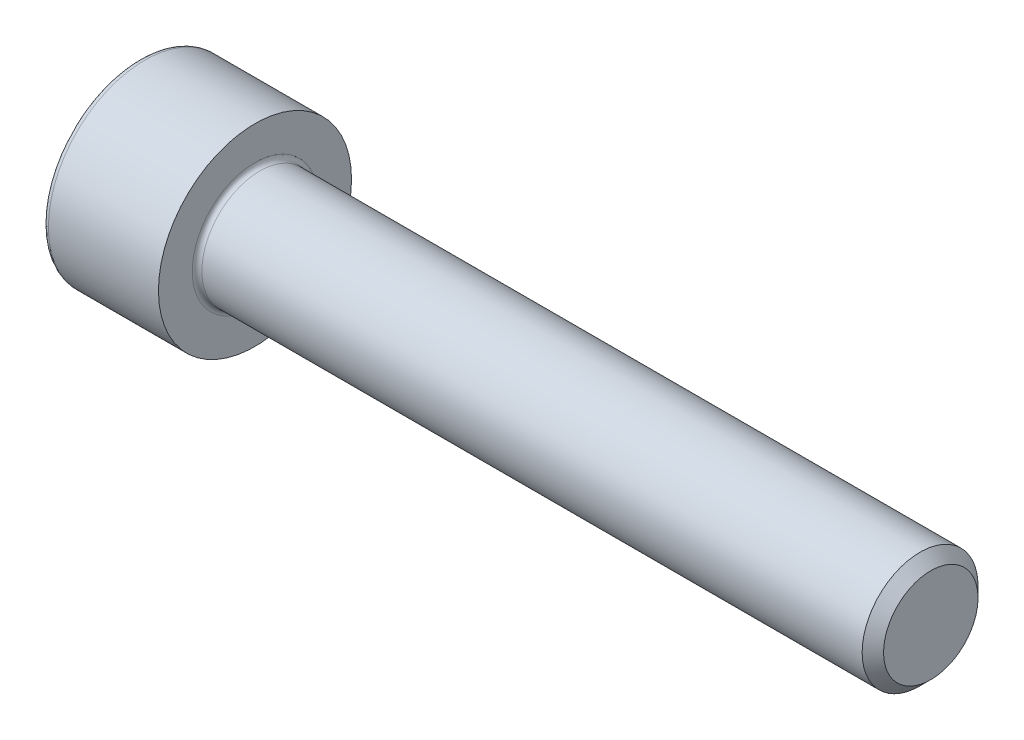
from build123d import *

# Parameters (mm, degrees)
FILLET1_R   = 0.25
FILLET2_R   = 0.3
HEX_2_DEPTH = 3


with BuildPart() as part:
    # BodySke → Base-Revolve (revolve)
    with BuildSketch(Plane.XY, mode=Mode.PRIVATE) as base_revolve_sk:
        Polygon((0, 0), (0, 5), (6, 5), (6, 3), (40.4455, 3), (41, 2.4455), (41, 0), align=None)
    revolve(base_revolve_sk.sketch.rotate(Axis((-31.75, 0, 0), (1, 0, 0)), 90), axis=Axis((-31.75, 0, 0), (1, 0, 0)))

    # Fillet1
    fillet1_edges = [part.edges().sort_by_distance(p)[0] for p in [
        (6, 0, -3),
    ]]
    fillet(fillet1_edges, radius=FILLET1_R)

    # Fillet2
    fillet2_edges = [part.edges().sort_by_distance(p)[0] for p in [
        (0, 0, -5),
    ]]
    fillet(fillet2_edges, radius=FILLET2_R)

    # Sketch2 → Hex-PreBroach (revolve, cut)
    with BuildSketch(Plane.XY, mode=Mode.PRIVATE) as hex_prebroach_sk:
        Polygon((0, 2.542), (3, 2.542), (4.467624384, 0), (0, 0), align=None)
    revolve(hex_prebroach_sk.sketch.rotate(Axis((0, 0, 0), (1, 0, 0)), 90), axis=Axis((0, 0, 0), (1, 0, 0)), mode=Mode.SUBTRACT)

    # Sketch3 → Hex 2 (cut)
    with BuildSketch(Plane(origin=(0, 0, 0), x_dir=(0, 0.500000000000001, 0.866025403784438), z_dir=(-1, 0, 0))):
        Polygon((1.467624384, 2.542), (-1.467624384, 2.542), (-2.935248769, 0), (-1.467624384, -2.542), (1.467624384, -2.542), (2.935248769, 0), align=None)
    extrude(amount=-HEX_2_DEPTH, mode=Mode.SUBTRACT)


solid = part.part
